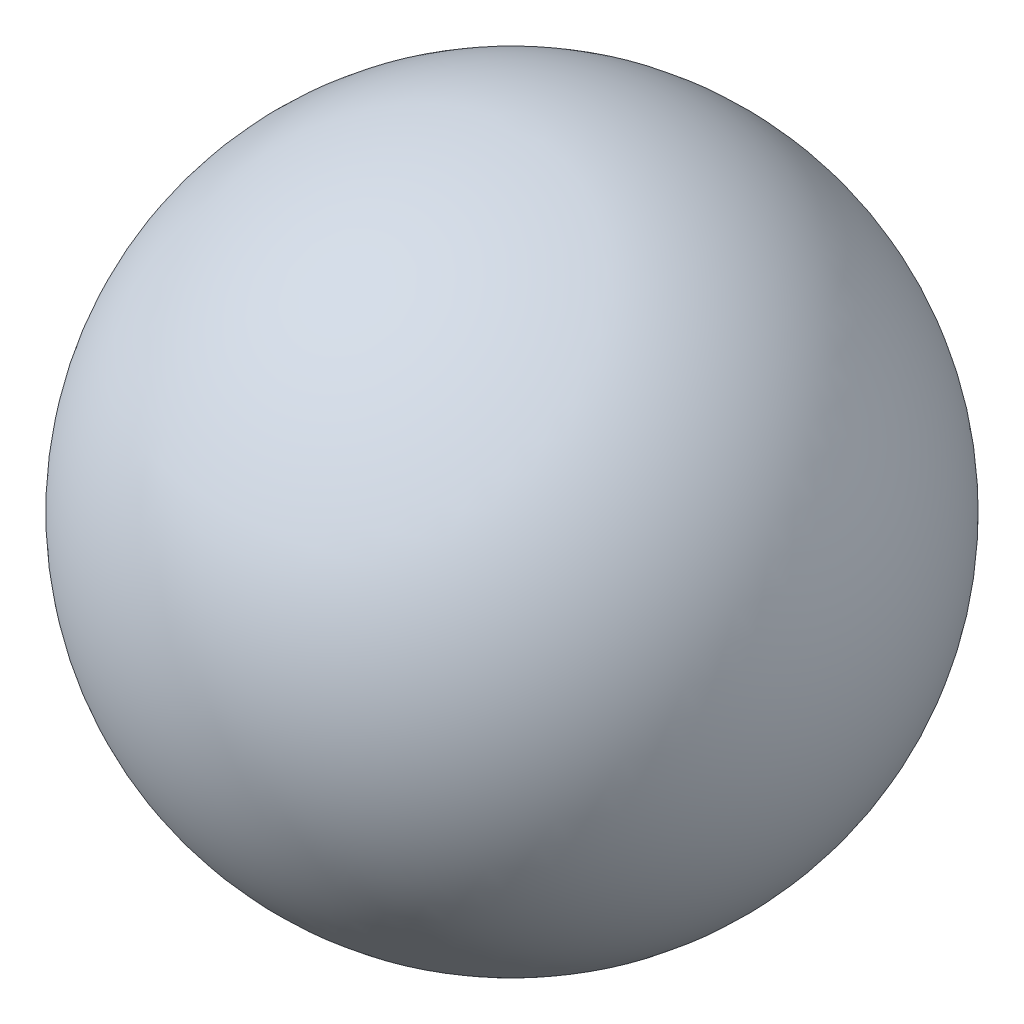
from build123d import *


with BuildPart() as part:
    # Sketch 1 → Revolve 1 (revolve)
    with BuildSketch(Plane.XY):
        with BuildLine():
            Line((0, -3), (0, 3))
            ThreePointArc((0, 3), (-3, 0), (0, -3))
        make_face()
    revolve(axis=Axis((0, -6.647855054, 0), (0, 1, 0)))


solid = part.part
